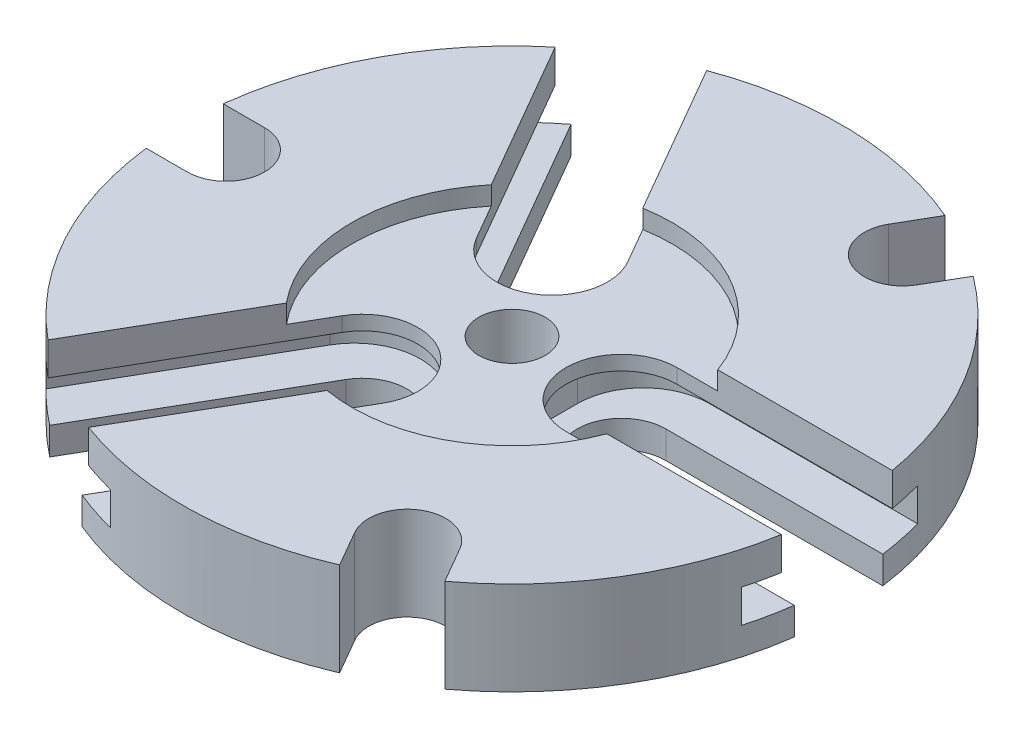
from build123d import *
from build123d.topology import SkipClean

# Parameters (mm, degrees)
SKETCH1_R          = 47.5488
EXTRUDE1_DEPTH     = 6.7437
CUT_EXTRUDE1_DEPTH = 69.583428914
CIRPATTERN1_COUNT  = 3
CUT_EXTRUDE2_DEPTH = 9.525
CIRPATTERN4_COUNT  = 3
EXTRUDE3_DEPTH     = 4.7498
CIRPATTERN5_COUNT  = 3
SKETCH6_R          = 4.7879
CUT_EXTRUDE3_DEPTH = 69.583428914
SKETCH7_R          = 23.114
CUT_EXTRUDE4_DEPTH = 2.667
CUT_EXTRUDE5_START = -13.4874
CUT_EXTRUDE5_DEPTH = 13.4874
CIRPATTERN6_COUNT  = 3


with BuildPart() as part:
    # Sketch1 → Extrude1 (new, symmetric)
    with BuildSketch(Plane(origin=(0, 0, 0), x_dir=(1, 0, 0), z_dir=(0, 1, 0))):
        with Locations(Location((0, 0, 0), (0, 0, 270))):
            Circle(SKETCH1_R)
    extrude(amount=EXTRUDE1_DEPTH, both=True)

    # Sketch2 → Cut-Extrude1 (cut, through all)
    with BuildSketch(Plane(origin=(0, 6.7437, 0), x_dir=(-1, 0, 0), z_dir=(0, 1, 0))):
        with BuildLine():
            Line((-15.7988, 6.3881), (-47.117730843, 6.3881))
            ThreePointArc((-47.117730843, 6.3881), (-47.5488, 0), (-47.117730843, -6.3881))
            Line((-47.117730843, -6.3881), (-15.7988, -6.3881))
            ThreePointArc((-15.7988, -6.3881), (-9.4107, 0), (-15.7988, 6.3881))
        make_face()
    cut_extrude1 = extrude(amount=-CUT_EXTRUDE1_DEPTH, mode=Mode.SUBTRACT)

    # CirPattern1: Cut-Extrude1 ×3 about axis
    cirpattern1_axis = Axis((0, 6.7437, 0), (0, -1, 0))
    for i in range(1, CIRPATTERN1_COUNT):
        add(cut_extrude1.rotate(cirpattern1_axis, i * 360 / CIRPATTERN1_COUNT), mode=Mode.SUBTRACT)

    # Sketch3 → Cut-Extrude2 (cut)
    with BuildSketch(Plane(origin=(0, 6.7437, 0), x_dir=(-1, 0, 0), z_dir=(0, 1, 0))):
        with BuildLine():
            Line((-15.7988, -12.7), (-45.821374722, -12.7))
            ThreePointArc((-45.821374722, -12.7), (-46.576596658, -9.566034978), (-47.117730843, -6.3881))
            Line((-47.117730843, -6.3881), (-15.7988, -6.3881))
            ThreePointArc((-15.7988, -6.3881), (-9.4107, 0), (-15.7988, 6.3881))
            Line((-15.7988, 6.3881), (-47.117730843, 6.3881))
            ThreePointArc((-47.117730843, 6.3881), (-46.576596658, 9.566034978), (-45.821374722, 12.7))
            Line((-45.821374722, 12.7), (-15.7988, 12.7))
            ThreePointArc((-15.7988, 12.7), (-9.063607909, 9.910192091), (-6.2738, 3.175))
            Line((-6.2738, 3.175), (-6.2738, -3.175))
            ThreePointArc((-6.2738, -3.175), (-9.063607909, -9.910192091), (-15.7988, -12.7))
        make_face()
    cut_extrude2 = extrude(amount=-CUT_EXTRUDE2_DEPTH, mode=Mode.SUBTRACT)

    # CirPattern4: Cut-Extrude2 ×3 about axis
    cirpattern4_axis = Axis((0, 6.7437, 0), (0, -1, 0))
    for i in range(1, CIRPATTERN4_COUNT):
        add(cut_extrude2.rotate(cirpattern4_axis, i * 360 / CIRPATTERN4_COUNT), mode=Mode.SUBTRACT)

    # Sketch5 → Extrude3 (add)
    with BuildSketch(Plane(origin=(0, 6.7437, 0), x_dir=(-1, 0, 0), z_dir=(0, 1, 0))):
        with BuildLine():
            Line((-46.870805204, -8.001), (-15.7988, -8.001))
            ThreePointArc((-15.7988, -8.001), (-7.7978, 0), (-15.7988, 8.001))
            Line((-15.7988, 8.001), (-46.870805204, 8.001))
            ThreePointArc((-46.870805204, 8.001), (-46.40560532, 10.3637916), (-45.821374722, 12.7))
            Line((-45.821374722, 12.7), (-15.7988, 12.7))
            ThreePointArc((-15.7988, 12.7), (-9.063607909, 9.910192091), (-6.2738, 3.175))
            Line((-6.2738, 3.175), (-6.2738, -3.175))
            ThreePointArc((-6.2738, -3.175), (-9.063607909, -9.910192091), (-15.7988, -12.7))
            Line((-15.7988, -12.7), (-45.821374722, -12.7))
            ThreePointArc((-45.821374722, -12.7), (-46.40560532, -10.3637916), (-46.870805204, -8.001))
        make_face()
    extrude3 = extrude(amount=-EXTRUDE3_DEPTH)

    # CirPattern5: Extrude3 ×3 about axis
    with SkipClean():  # the faces are left unmerged after this step: merging them gives an invalid solid
        cirpattern5_axis = Axis((0, 0, 0), (0, 1, 0))
        for i in range(1, CIRPATTERN5_COUNT):
            add(extrude3.rotate(cirpattern5_axis, i * 360 / CIRPATTERN5_COUNT))

    # Sketch6 → Cut-Extrude3 (cut, through all)
    with SkipClean():  # the faces are left unmerged after this step: merging them gives an invalid solid
        with BuildSketch(Plane(origin=(0, 6.7437, 0), x_dir=(-1, 0, 0), z_dir=(0, 1, 0))):
            with Locations(Location((0, 0, 0), (0, 0, 90))):
                Circle(SKETCH6_R)
        extrude(amount=-CUT_EXTRUDE3_DEPTH, mode=Mode.SUBTRACT)

    # Sketch7 → Cut-Extrude4 (cut)
    with SkipClean():  # the faces are left unmerged after this step: merging them gives an invalid solid
        with BuildSketch(Plane(origin=(0, 6.7437, 0), x_dir=(-1, 0, 0), z_dir=(0, 1, 0))):
            Circle(SKETCH7_R)
        extrude(amount=-CUT_EXTRUDE4_DEPTH, mode=Mode.SUBTRACT)

    # Sketch8 → Cut-Extrude5 (cut)
    with SkipClean():  # the faces are left unmerged after this step: merging them gives an invalid solid
        with BuildSketch(Plane.XZ.offset(6.7437).offset(CUT_EXTRUDE5_START)):
            with BuildLine():
                Line((25.44935365, 32.967073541), (28.423378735, 38.118236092))
                ThreePointArc((28.423378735, 38.118236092), (23.7744, 41.178468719), (18.799671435, 43.674486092))
                Line((18.799671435, 43.674486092), (15.82564635, 38.523323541))
                ThreePointArc((15.82564635, 38.523323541), (17.859375, 30.933344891), (25.44935365, 32.967073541))
            make_face()
        cut_extrude5 = extrude(amount=CUT_EXTRUDE5_DEPTH, mode=Mode.SUBTRACT)

    # CirPattern6: Cut-Extrude5 ×3 about axis
    with SkipClean():  # the faces are left unmerged after this step: merging them gives an invalid solid
        cirpattern6_axis = Axis((0, 6.7437, 0), (0, -1, 0))
        for i in range(1, CIRPATTERN6_COUNT):
            add(cut_extrude5.rotate(cirpattern6_axis, i * 360 / CIRPATTERN6_COUNT), mode=Mode.SUBTRACT)


solid = part.part
